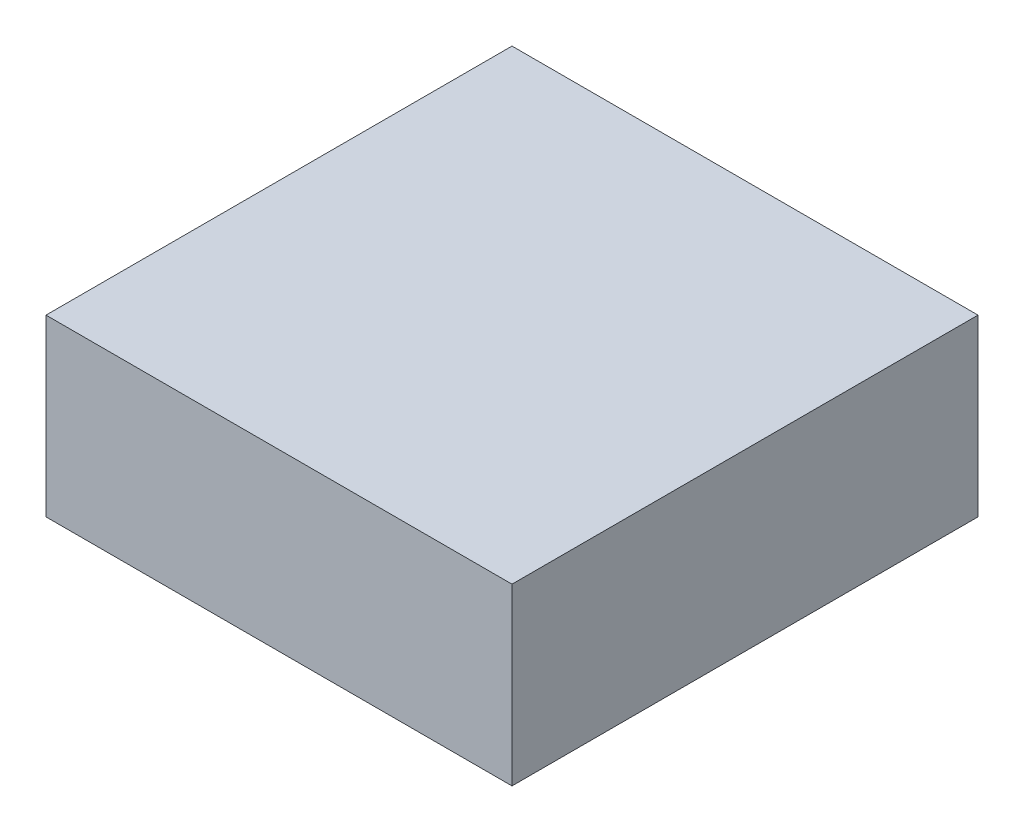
ISO-10303-21;
HEADER;
FILE_DESCRIPTION(('STEP AP214'),'2;1');
FILE_NAME('part.step','',(''),(''),'','','');
FILE_SCHEMA(('AUTOMOTIVE_DESIGN { 1 0 10303 214 1 1 1 1 }'));
ENDSEC;
DATA;
#1=APPLICATION_CONTEXT('core data for automotive mechanical design processes');
#2=APPLICATION_PROTOCOL_DEFINITION('international standard','automotive_design',2000,#1);
#3=PRODUCT_CONTEXT('',#1,'mechanical');
#4=PRODUCT('Part','Part','',(#3));
#5=PRODUCT_RELATED_PRODUCT_CATEGORY('part','',(#4));
#6=PRODUCT_DEFINITION_FORMATION('','',#4);
#7=PRODUCT_DEFINITION_CONTEXT('part definition',#1,'design');
#8=PRODUCT_DEFINITION('design','',#6,#7);
#9=PRODUCT_DEFINITION_SHAPE('','',#8);
#10=(LENGTH_UNIT() NAMED_UNIT(*) SI_UNIT(.MILLI.,.METRE.));
#11=(NAMED_UNIT(*) PLANE_ANGLE_UNIT() SI_UNIT($,.RADIAN.));
#12=(NAMED_UNIT(*) SI_UNIT($,.STERADIAN.) SOLID_ANGLE_UNIT());
#13=UNCERTAINTY_MEASURE_WITH_UNIT(LENGTH_MEASURE(1.E-05),#10,'distance_accuracy_value','');
#14=(GEOMETRIC_REPRESENTATION_CONTEXT(3) GLOBAL_UNCERTAINTY_ASSIGNED_CONTEXT((#13)) GLOBAL_UNIT_ASSIGNED_CONTEXT((#10,
#11,#12)) REPRESENTATION_CONTEXT('',''));
#15=CARTESIAN_POINT('',(0.,0.,0.));
#16=DIRECTION('',(0.,0.,1.));
#17=DIRECTION('',(1.,0.,0.));
#18=AXIS2_PLACEMENT_3D('',#15,#16,#17);
#19=CARTESIAN_POINT('',(101.6,-19.05,0.));
#20=DIRECTION('',(0.,1.,0.));
#21=DIRECTION('',(0.,0.,1.));
#22=AXIS2_PLACEMENT_3D('',#19,#20,#21);
#23=PLANE('',#22);
#24=DIRECTION('',(0.,0.,-1.));
#25=VECTOR('',#24,1.);
#26=CARTESIAN_POINT('',(0.,-19.05,0.));
#27=LINE('',#26,#25);
#28=CARTESIAN_POINT('',(0.,-19.05,50.8));
#29=VERTEX_POINT('',#28);
#30=CARTESIAN_POINT('',(0.,-19.05,-50.8));
#31=VERTEX_POINT('',#30);
#32=EDGE_CURVE('E97',#29,#31,#27,.T.);
#33=ORIENTED_EDGE('',*,*,#32,.T.);
#34=DIRECTION('',(-1.,0.,0.));
#35=VECTOR('',#34,1.);
#36=CARTESIAN_POINT('',(101.6,-19.05,-50.8));
#37=LINE('',#36,#35);
#38=CARTESIAN_POINT('',(101.6,-19.05,-50.8));
#39=VERTEX_POINT('',#38);
#40=EDGE_CURVE('E11',#39,#31,#37,.T.);
#41=ORIENTED_EDGE('',*,*,#40,.F.);
#42=DIRECTION('',(0.,0.,-1.));
#43=VECTOR('',#42,1.);
#44=CARTESIAN_POINT('',(101.6,-19.05,0.));
#45=LINE('',#44,#43);
#46=CARTESIAN_POINT('',(101.6,-19.05,50.8));
#47=VERTEX_POINT('',#46);
#48=EDGE_CURVE('E83',#47,#39,#45,.T.);
#49=ORIENTED_EDGE('',*,*,#48,.F.);
#50=DIRECTION('',(-1.,0.,0.));
#51=VECTOR('',#50,1.);
#52=CARTESIAN_POINT('',(101.6,-19.05,50.8));
#53=LINE('',#52,#51);
#54=EDGE_CURVE('E50',#47,#29,#53,.T.);
#55=ORIENTED_EDGE('',*,*,#54,.T.);
#56=EDGE_LOOP('',(#33,#41,#49,#55));
#57=FACE_BOUND('',#56,.T.);
#58=ADVANCED_FACE('F34',(#57),#23,.F.);
#59=CARTESIAN_POINT('',(101.6,0.,-50.8));
#60=DIRECTION('',(0.,0.,1.));
#61=DIRECTION('',(1.,0.,0.));
#62=AXIS2_PLACEMENT_3D('',#59,#60,#61);
#63=PLANE('',#62);
#64=DIRECTION('',(0.,1.,0.));
#65=VECTOR('',#64,1.);
#66=CARTESIAN_POINT('',(0.,0.,-50.8));
#67=LINE('',#66,#65);
#68=CARTESIAN_POINT('',(0.,19.05,-50.8));
#69=VERTEX_POINT('',#68);
#70=EDGE_CURVE('E88',#31,#69,#67,.T.);
#71=ORIENTED_EDGE('',*,*,#70,.T.);
#72=DIRECTION('',(-1.,0.,0.));
#73=VECTOR('',#72,1.);
#74=CARTESIAN_POINT('',(101.6,19.05,-50.8));
#75=LINE('',#74,#73);
#76=CARTESIAN_POINT('',(101.6,19.05,-50.8));
#77=VERTEX_POINT('',#76);
#78=EDGE_CURVE('E42',#77,#69,#75,.T.);
#79=ORIENTED_EDGE('',*,*,#78,.F.);
#80=DIRECTION('',(0.,1.,0.));
#81=VECTOR('',#80,1.);
#82=CARTESIAN_POINT('',(101.6,0.,-50.8));
#83=LINE('',#82,#81);
#84=EDGE_CURVE('E75',#39,#77,#83,.T.);
#85=ORIENTED_EDGE('',*,*,#84,.F.);
#86=ORIENTED_EDGE('',*,*,#40,.T.);
#87=EDGE_LOOP('',(#71,#79,#85,#86));
#88=FACE_BOUND('',#87,.T.);
#89=ADVANCED_FACE('F87',(#88),#63,.F.);
#90=CARTESIAN_POINT('',(101.6,19.05,0.));
#91=DIRECTION('',(0.,1.,0.));
#92=DIRECTION('',(0.,0.,1.));
#93=AXIS2_PLACEMENT_3D('',#90,#91,#92);
#94=PLANE('',#93);
#95=DIRECTION('',(0.,0.,-1.));
#96=VECTOR('',#95,1.);
#97=CARTESIAN_POINT('',(0.,19.05,0.));
#98=LINE('',#97,#96);
#99=CARTESIAN_POINT('',(0.,19.05,50.8));
#100=VERTEX_POINT('',#99);
#101=EDGE_CURVE('E100',#100,#69,#98,.T.);
#102=ORIENTED_EDGE('',*,*,#101,.F.);
#103=DIRECTION('',(-1.,0.,0.));
#104=VECTOR('',#103,1.);
#105=CARTESIAN_POINT('',(101.6,19.05,50.8));
#106=LINE('',#105,#104);
#107=CARTESIAN_POINT('',(101.6,19.05,50.8));
#108=VERTEX_POINT('',#107);
#109=EDGE_CURVE('E64',#108,#100,#106,.T.);
#110=ORIENTED_EDGE('',*,*,#109,.F.);
#111=DIRECTION('',(0.,0.,-1.));
#112=VECTOR('',#111,1.);
#113=CARTESIAN_POINT('',(101.6,19.05,0.));
#114=LINE('',#113,#112);
#115=EDGE_CURVE('E82',#108,#77,#114,.T.);
#116=ORIENTED_EDGE('',*,*,#115,.T.);
#117=ORIENTED_EDGE('',*,*,#78,.T.);
#118=EDGE_LOOP('',(#102,#110,#116,#117));
#119=FACE_BOUND('',#118,.T.);
#120=ADVANCED_FACE('F91',(#119),#94,.T.);
#121=CARTESIAN_POINT('',(101.6,0.,50.8));
#122=DIRECTION('',(0.,0.,1.));
#123=DIRECTION('',(1.,0.,0.));
#124=AXIS2_PLACEMENT_3D('',#121,#122,#123);
#125=PLANE('',#124);
#126=DIRECTION('',(0.,1.,0.));
#127=VECTOR('',#126,1.);
#128=CARTESIAN_POINT('',(0.,0.,50.8));
#129=LINE('',#128,#127);
#130=EDGE_CURVE('E102',#29,#100,#129,.T.);
#131=ORIENTED_EDGE('',*,*,#130,.F.);
#132=ORIENTED_EDGE('',*,*,#54,.F.);
#133=DIRECTION('',(0.,1.,0.));
#134=VECTOR('',#133,1.);
#135=CARTESIAN_POINT('',(101.6,0.,50.8));
#136=LINE('',#135,#134);
#137=EDGE_CURVE('E92',#47,#108,#136,.T.);
#138=ORIENTED_EDGE('',*,*,#137,.T.);
#139=ORIENTED_EDGE('',*,*,#109,.T.);
#140=EDGE_LOOP('',(#131,#132,#138,#139));
#141=FACE_BOUND('',#140,.T.);
#142=ADVANCED_FACE('F108',(#141),#125,.T.);
#143=CARTESIAN_POINT('',(101.6,0.,0.));
#144=DIRECTION('',(1.,0.,0.));
#145=DIRECTION('',(0.,0.,-1.));
#146=AXIS2_PLACEMENT_3D('',#143,#144,#145);
#147=PLANE('',#146);
#148=ORIENTED_EDGE('',*,*,#48,.T.);
#149=ORIENTED_EDGE('',*,*,#84,.T.);
#150=ORIENTED_EDGE('',*,*,#115,.F.);
#151=ORIENTED_EDGE('',*,*,#137,.F.);
#152=EDGE_LOOP('',(#148,#149,#150,#151));
#153=FACE_BOUND('',#152,.T.);
#154=ADVANCED_FACE('F79',(#153),#147,.T.);
#155=CARTESIAN_POINT('',(0.,0.,0.));
#156=DIRECTION('',(1.,0.,0.));
#157=DIRECTION('',(0.,0.,-1.));
#158=AXIS2_PLACEMENT_3D('',#155,#156,#157);
#159=PLANE('',#158);
#160=ORIENTED_EDGE('',*,*,#32,.F.);
#161=ORIENTED_EDGE('',*,*,#130,.T.);
#162=ORIENTED_EDGE('',*,*,#101,.T.);
#163=ORIENTED_EDGE('',*,*,#70,.F.);
#164=EDGE_LOOP('',(#160,#161,#162,#163));
#165=FACE_BOUND('',#164,.T.);
#166=ADVANCED_FACE('F107',(#165),#159,.F.);
#167=CLOSED_SHELL('',(#58,#89,#120,#142,#154,#166));
#168=MANIFOLD_SOLID_BREP('B2',#167);
#169=ADVANCED_BREP_SHAPE_REPRESENTATION('',(#18,#168),#14);
#170=SHAPE_DEFINITION_REPRESENTATION(#9,#169);
ENDSEC;
END-ISO-10303-21;
